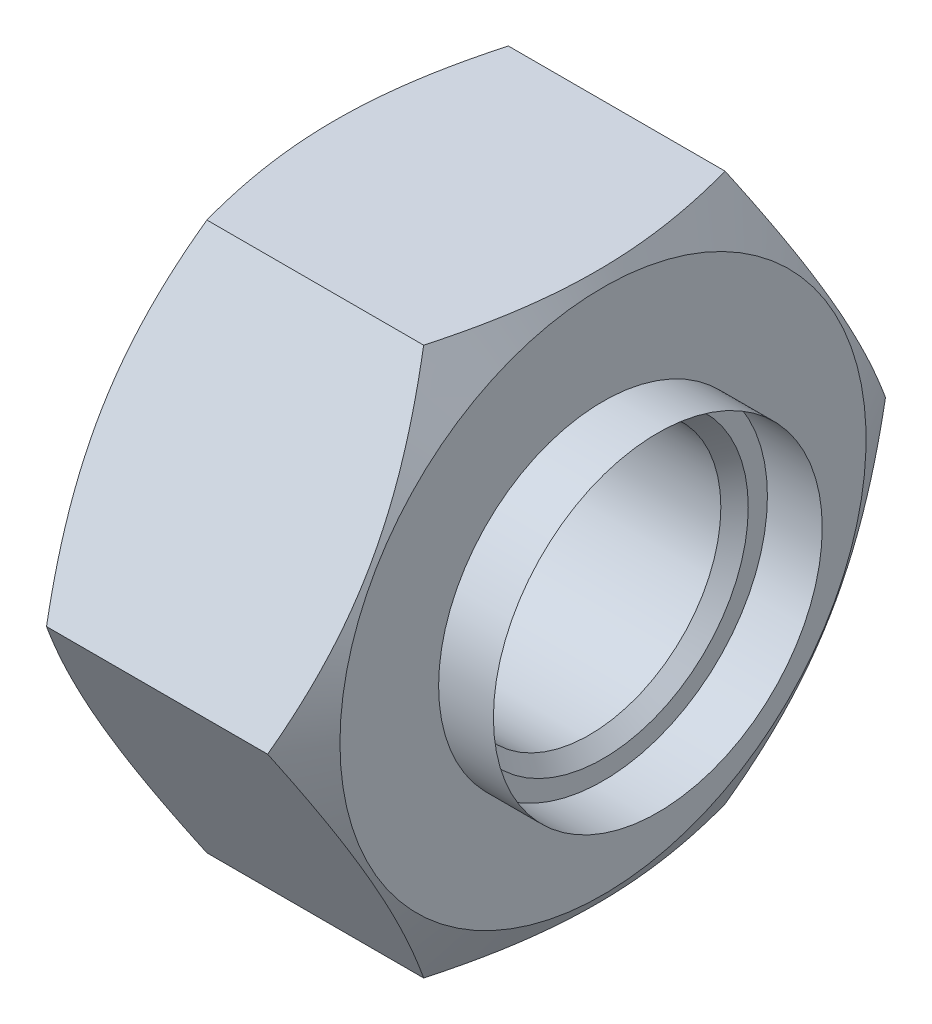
ISO-10303-21;
HEADER;
FILE_DESCRIPTION(('STEP AP214'),'2;1');
FILE_NAME('part.step','',(''),(''),'','','');
FILE_SCHEMA(('AUTOMOTIVE_DESIGN { 1 0 10303 214 1 1 1 1 }'));
ENDSEC;
DATA;
#1=APPLICATION_CONTEXT('core data for automotive mechanical design processes');
#2=APPLICATION_PROTOCOL_DEFINITION('international standard','automotive_design',2000,#1);
#3=PRODUCT_CONTEXT('',#1,'mechanical');
#4=PRODUCT('Part','Part','',(#3));
#5=PRODUCT_RELATED_PRODUCT_CATEGORY('part','',(#4));
#6=PRODUCT_DEFINITION_FORMATION('','',#4);
#7=PRODUCT_DEFINITION_CONTEXT('part definition',#1,'design');
#8=PRODUCT_DEFINITION('design','',#6,#7);
#9=PRODUCT_DEFINITION_SHAPE('','',#8);
#10=(LENGTH_UNIT() NAMED_UNIT(*) SI_UNIT(.MILLI.,.METRE.));
#11=(NAMED_UNIT(*) PLANE_ANGLE_UNIT() SI_UNIT($,.RADIAN.));
#12=(NAMED_UNIT(*) SI_UNIT($,.STERADIAN.) SOLID_ANGLE_UNIT());
#13=UNCERTAINTY_MEASURE_WITH_UNIT(LENGTH_MEASURE(1.E-05),#10,'distance_accuracy_value','');
#14=(GEOMETRIC_REPRESENTATION_CONTEXT(3) GLOBAL_UNCERTAINTY_ASSIGNED_CONTEXT((#13)) GLOBAL_UNIT_ASSIGNED_CONTEXT((#10,
#11,#12)) REPRESENTATION_CONTEXT('',''));
#15=CARTESIAN_POINT('',(0.,0.,0.));
#16=DIRECTION('',(0.,0.,1.));
#17=DIRECTION('',(1.,0.,0.));
#18=AXIS2_PLACEMENT_3D('',#15,#16,#17);
#19=CARTESIAN_POINT('',(-5.,0.,0.));
#20=DIRECTION('',(-1.,0.,0.));
#21=DIRECTION('',(0.,0.,1.));
#22=AXIS2_PLACEMENT_3D('',#19,#20,#21);
#23=CYLINDRICAL_SURFACE('',#22,3.);
#24=CARTESIAN_POINT('',(1.,0.,0.));
#25=DIRECTION('',(-1.,0.,0.));
#26=DIRECTION('',(0.,0.,1.));
#27=AXIS2_PLACEMENT_3D('',#24,#25,#26);
#28=CIRCLE('',#27,3.);
#29=CARTESIAN_POINT('',(1.,0.,3.));
#30=VERTEX_POINT('',#29);
#31=EDGE_CURVE('P0_E15',#30,#30,#28,.T.);
#32=ORIENTED_EDGE('',*,*,#31,.T.);
#33=EDGE_LOOP('',(#32));
#34=FACE_BOUND('',#33,.T.);
#35=CARTESIAN_POINT('',(-5.,0.,0.));
#36=DIRECTION('',(-1.,0.,0.));
#37=DIRECTION('',(0.,0.,1.));
#38=AXIS2_PLACEMENT_3D('',#35,#36,#37);
#39=CIRCLE('',#38,3.);
#40=CARTESIAN_POINT('',(-5.,0.,3.));
#41=VERTEX_POINT('',#40);
#42=EDGE_CURVE('P0_E10',#41,#41,#39,.F.);
#43=ORIENTED_EDGE('',*,*,#42,.T.);
#44=EDGE_LOOP('',(#43));
#45=FACE_BOUND('',#44,.T.);
#46=ADVANCED_FACE('P0_F14',(#34,#45),#23,.T.);
#47=OPEN_SHELL('',(#46));
#48=SHELL_BASED_SURFACE_MODEL('P0_B1',(#47));
#49=CARTESIAN_POINT('',(0.,27.5,-24.98464223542));
#50=DIRECTION('',(-1.,0.,0.));
#51=DIRECTION('',(0.,0.,1.));
#52=AXIS2_PLACEMENT_3D('',#49,#50,#51);
#53=PLANE('',#52);
#54=CARTESIAN_POINT('',(5.6843418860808E-11,0.,0.));
#55=DIRECTION('',(1.,0.,0.));
#56=DIRECTION('',(0.,0.,-1.));
#57=AXIS2_PLACEMENT_3D('',#54,#55,#56);
#58=CIRCLE('',#57,2.65000000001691);
#59=CARTESIAN_POINT('',(5.6843418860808E-11,0.,-2.65000000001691));
#60=VERTEX_POINT('',#59);
#61=EDGE_CURVE('P1_E78',#60,#60,#58,.F.);
#62=ORIENTED_EDGE('',*,*,#61,.T.);
#63=EDGE_LOOP('',(#62));
#64=FACE_BOUND('',#63,.T.);
#65=CARTESIAN_POINT('',(0.,0.,0.));
#66=DIRECTION('',(-1.,0.,0.));
#67=DIRECTION('',(0.,0.,1.));
#68=AXIS2_PLACEMENT_3D('',#65,#66,#67);
#69=CIRCLE('',#68,4.79999999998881);
#70=CARTESIAN_POINT('',(0.,0.,4.79999999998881));
#71=VERTEX_POINT('',#70);
#72=EDGE_CURVE('P1_E19',#71,#71,#69,.T.);
#73=ORIENTED_EDGE('',*,*,#72,.F.);
#74=EDGE_LOOP('',(#73));
#75=FACE_BOUND('',#74,.T.);
#76=ADVANCED_FACE('P1_F16',(#64,#75),#53,.F.);
#77=CARTESIAN_POINT('',(-0.526035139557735,0.,0.));
#78=DIRECTION('',(-1.,0.,0.));
#79=DIRECTION('',(0.,0.,1.));
#80=AXIS2_PLACEMENT_3D('',#77,#78,#79);
#81=CONICAL_SURFACE('',#80,5.71179424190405,1.04751800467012);
#82=ORIENTED_EDGE('',*,*,#72,.T.);
#83=EDGE_LOOP('',(#82));
#84=FACE_BOUND('',#83,.T.);
#85=CARTESIAN_POINT('',(-0.522897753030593,-5.,-2.75000000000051));
#86=CARTESIAN_POINT('',(-0.460057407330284,-5.,-2.52404723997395));
#87=CARTESIAN_POINT('',(-0.402715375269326,-5.,-2.29639349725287));
#88=CARTESIAN_POINT('',(-0.301612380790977,-5.,-1.83766805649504));
#89=CARTESIAN_POINT('',(-0.25787706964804,-5.,-1.60659075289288));
#90=CARTESIAN_POINT('',(-0.187587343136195,-5.,-1.14682143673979));
#91=CARTESIAN_POINT('',(-0.160685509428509,-5.,-0.918184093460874));
#92=CARTESIAN_POINT('',(-0.12459225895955,-5.,-0.459696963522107));
#93=CARTESIAN_POINT('',(-0.115384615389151,-5.,-0.229848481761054));
#94=CARTESIAN_POINT('',(-0.115384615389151,-5.,0.229848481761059));
#95=CARTESIAN_POINT('',(-0.124592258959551,-5.,0.459696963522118));
#96=CARTESIAN_POINT('',(-0.160685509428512,-5.,0.918184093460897));
#97=CARTESIAN_POINT('',(-0.187587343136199,-5.,1.14682143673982));
#98=CARTESIAN_POINT('',(-0.257877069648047,-5.,1.60659075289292));
#99=CARTESIAN_POINT('',(-0.301612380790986,-5.,1.83766805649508));
#100=CARTESIAN_POINT('',(-0.40271537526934,-5.,2.29639349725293));
#101=CARTESIAN_POINT('',(-0.460057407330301,-5.,2.52404723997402));
#102=CARTESIAN_POINT('',(-0.522897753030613,-5.,2.75000000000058));
#103=B_SPLINE_CURVE_WITH_KNOTS('',3,(#85,#86,#87,#88,#89,#90,#91,#92,#93,#94,#95,#96,#97,#98,
#99,#100,#101,#102),.UNSPECIFIED.,.F.,.F.,(4,2,2,2,2,2,2,2,4),(0.,0.703766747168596,
1.40885230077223,2.09885933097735,2.78823327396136,3.47760721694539,4.16761424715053,
4.87269980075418,5.5764665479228),.UNSPECIFIED.);
#104=CARTESIAN_POINT('',(-0.522897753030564,-5.00000000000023,-2.75));
#105=VERTEX_POINT('',#104);
#106=CARTESIAN_POINT('',(-0.522897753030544,-5.00000000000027,2.74999999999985));
#107=VERTEX_POINT('',#106);
#108=EDGE_CURVE('P1_E72',#105,#107,#103,.T.);
#109=ORIENTED_EDGE('',*,*,#108,.F.);
#110=CARTESIAN_POINT('',(-0.48274116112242,4.36393286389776E-13,-5.63675134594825));
#111=CARTESIAN_POINT('',(-0.411260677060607,-0.214538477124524,-5.51288749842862));
#112=CARTESIAN_POINT('',(-0.346254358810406,-0.43092623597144,-5.38795596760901));
#113=CARTESIAN_POINT('',(-0.232789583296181,-0.8674484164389,-5.13592976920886));
#114=CARTESIAN_POINT('',(-0.184371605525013,-1.08759064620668,-5.00883059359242));
#115=CARTESIAN_POINT('',(-0.109022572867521,-1.52507066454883,-4.75625138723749));
#116=CARTESIAN_POINT('',(-0.0815831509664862,-1.74234034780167,-4.63081067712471));
#117=CARTESIAN_POINT('',(-0.048826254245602,-2.17789309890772,-4.37934417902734));
#118=CARTESIAN_POINT('',(-0.0434812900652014,-2.39617456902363,-4.25331931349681));
#119=CARTESIAN_POINT('',(-0.0548801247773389,-2.81409569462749,-4.01203243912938));
#120=CARTESIAN_POINT('',(-0.0698224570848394,-3.01377478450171,-3.89674766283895));
#121=CARTESIAN_POINT('',(-0.117432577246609,-3.4117266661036,-3.66699003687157));
#122=CARTESIAN_POINT('',(-0.150119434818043,-3.60999771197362,-3.55251819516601));
#123=CARTESIAN_POINT('',(-0.231804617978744,-4.00878966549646,-3.32227555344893));
#124=CARTESIAN_POINT('',(-0.281171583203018,-4.20925232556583,-3.2065383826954));
#125=CARTESIAN_POINT('',(-0.392969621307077,-4.60696569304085,-2.97691846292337));
#126=CARTESIAN_POINT('',(-0.455370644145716,-4.80422268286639,-2.86303208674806));
#127=CARTESIAN_POINT('',(-0.522897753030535,-5.00000000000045,-2.74999999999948));
#128=B_SPLINE_CURVE_WITH_KNOTS('',3,(#110,#111,#112,#113,#114,#115,#116,#117,#118,#119,#120,
#121,#122,#123,#124,#125,#126,#127),.UNSPECIFIED.,.F.,.F.,(4,2,2,2,2,2,2,2,4),(0.,
0.77380589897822,1.54948683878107,2.30571654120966,3.06100507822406,3.75342935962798,
4.44659925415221,5.15621689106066,5.86421621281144),.UNSPECIFIED.);
#129=CARTESIAN_POINT('',(-0.482741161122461,0.,-5.63675134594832));
#130=VERTEX_POINT('',#129);
#131=EDGE_CURVE('P1_E91',#130,#105,#128,.T.);
#132=ORIENTED_EDGE('',*,*,#131,.F.);
#133=CARTESIAN_POINT('',(-0.522897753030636,5.00000000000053,-2.74999999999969));
#134=CARTESIAN_POINT('',(-0.44821579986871,4.78348598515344,-2.87500442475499));
#135=CARTESIAN_POINT('',(-0.379798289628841,4.56513107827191,-3.00107168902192));
#136=CARTESIAN_POINT('',(-0.259235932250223,4.12449649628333,-3.2554721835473));
#137=CARTESIAN_POINT('',(-0.207135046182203,3.90220789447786,-3.38381056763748));
#138=CARTESIAN_POINT('',(-0.124458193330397,3.46032899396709,-3.6389294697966));
#139=CARTESIAN_POINT('',(-0.0933673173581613,3.24081438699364,-3.76566628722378));
#140=CARTESIAN_POINT('',(-0.0634606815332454,2.91058577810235,-3.9563238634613));
#141=CARTESIAN_POINT('',(-0.0562794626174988,2.80040896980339,-4.01993447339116));
#142=CARTESIAN_POINT('',(-0.04762970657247,2.57988872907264,-4.14725189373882));
#143=CARTESIAN_POINT('',(-0.0461610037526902,2.4695453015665,-4.2109587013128));
#144=CARTESIAN_POINT('',(-0.0501283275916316,2.16188369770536,-4.38858721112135));
#145=CARTESIAN_POINT('',(-0.0619232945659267,1.96460341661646,-4.50248703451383));
#146=CARTESIAN_POINT('',(-0.103089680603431,1.57126669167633,-4.7295800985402));
#147=CARTESIAN_POINT('',(-0.132479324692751,1.37521173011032,-4.8427724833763));
#148=CARTESIAN_POINT('',(-0.207547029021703,0.980802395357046,-5.07048481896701));
#149=CARTESIAN_POINT('',(-0.253590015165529,0.782501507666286,-5.18497388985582));
#150=CARTESIAN_POINT('',(-0.358930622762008,0.388980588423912,-5.41217329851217));
#151=CARTESIAN_POINT('',(-0.41819977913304,0.19375489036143,-5.52488690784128));
#152=CARTESIAN_POINT('',(-0.482741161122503,-2.37488008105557E-13,-5.6367513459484));
#153=B_SPLINE_CURVE_WITH_KNOTS('',3,(#133,#134,#135,#136,#137,#138,#139,#140,#141,#142,#143,
#144,#145,#146,#147,#148,#149,#150,#151,#152),.UNSPECIFIED.,.F.,.F.,(4,2,2,2,2,2,2,2,2,4),(0.,
0.783055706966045,1.56820336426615,2.33333381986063,2.71549280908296,3.09764071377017,
3.78117114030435,4.46541081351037,5.16565571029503,5.86440784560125),.UNSPECIFIED.);
#154=CARTESIAN_POINT('',(-0.522897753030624,5.00000000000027,-2.75000000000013));
#155=VERTEX_POINT('',#154);
#156=EDGE_CURVE('P1_E130',#155,#130,#153,.T.);
#157=ORIENTED_EDGE('',*,*,#156,.F.);
#158=CARTESIAN_POINT('',(-0.522897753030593,5.,2.75000000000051));
#159=CARTESIAN_POINT('',(-0.460057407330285,5.,2.52404723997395));
#160=CARTESIAN_POINT('',(-0.402715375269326,5.,2.29639349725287));
#161=CARTESIAN_POINT('',(-0.301612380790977,5.,1.83766805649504));
#162=CARTESIAN_POINT('',(-0.25787706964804,5.,1.60659075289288));
#163=CARTESIAN_POINT('',(-0.187587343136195,5.,1.14682143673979));
#164=CARTESIAN_POINT('',(-0.16068550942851,5.,0.918184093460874));
#165=CARTESIAN_POINT('',(-0.12459225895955,5.,0.459696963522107));
#166=CARTESIAN_POINT('',(-0.115384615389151,5.,0.229848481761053));
#167=CARTESIAN_POINT('',(-0.115384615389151,5.,-0.229848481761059));
#168=CARTESIAN_POINT('',(-0.124592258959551,5.,-0.459696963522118));
#169=CARTESIAN_POINT('',(-0.160685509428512,5.,-0.918184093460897));
#170=CARTESIAN_POINT('',(-0.187587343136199,5.,-1.14682143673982));
#171=CARTESIAN_POINT('',(-0.257877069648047,5.,-1.60659075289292));
#172=CARTESIAN_POINT('',(-0.301612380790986,5.,-1.83766805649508));
#173=CARTESIAN_POINT('',(-0.40271537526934,5.,-2.29639349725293));
#174=CARTESIAN_POINT('',(-0.460057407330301,5.,-2.52404723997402));
#175=CARTESIAN_POINT('',(-0.522897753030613,5.,-2.75000000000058));
#176=B_SPLINE_CURVE_WITH_KNOTS('',3,(#158,#159,#160,#161,#162,#163,#164,#165,#166,#167,#168,
#169,#170,#171,#172,#173,#174,#175),.UNSPECIFIED.,.F.,.F.,(4,2,2,2,2,2,2,2,4),(0.,
0.703766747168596,1.40885230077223,2.09885933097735,2.78823327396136,3.47760721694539,
4.16761424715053,4.87269980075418,5.5764665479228),.UNSPECIFIED.);
#177=CARTESIAN_POINT('',(-0.522897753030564,5.00000000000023,2.75));
#178=VERTEX_POINT('',#177);
#179=EDGE_CURVE('P1_E137',#178,#155,#176,.T.);
#180=ORIENTED_EDGE('',*,*,#179,.F.);
#181=CARTESIAN_POINT('',(-0.482741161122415,-4.21141161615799E-13,5.63675134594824));
#182=CARTESIAN_POINT('',(-0.411260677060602,0.214538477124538,5.51288749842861));
#183=CARTESIAN_POINT('',(-0.346254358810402,0.430926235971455,5.387955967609));
#184=CARTESIAN_POINT('',(-0.232789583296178,0.867448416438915,5.13592976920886));
#185=CARTESIAN_POINT('',(-0.18437160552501,1.0875906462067,5.00883059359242));
#186=CARTESIAN_POINT('',(-0.109022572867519,1.52507066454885,4.75625138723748));
#187=CARTESIAN_POINT('',(-0.0815831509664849,1.74234034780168,4.63081067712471));
#188=CARTESIAN_POINT('',(-0.0488262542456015,2.17789309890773,4.37934417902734));
#189=CARTESIAN_POINT('',(-0.0434812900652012,2.39617456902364,4.2533193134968));
#190=CARTESIAN_POINT('',(-0.0548801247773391,2.8140956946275,4.01203243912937));
#191=CARTESIAN_POINT('',(-0.0698224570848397,3.01377478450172,3.89674766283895));
#192=CARTESIAN_POINT('',(-0.11743257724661,3.41172666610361,3.66699003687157));
#193=CARTESIAN_POINT('',(-0.150119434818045,3.60999771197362,3.552518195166));
#194=CARTESIAN_POINT('',(-0.231804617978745,4.00878966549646,3.32227555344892));
#195=CARTESIAN_POINT('',(-0.281171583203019,4.20925232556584,3.20653838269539));
#196=CARTESIAN_POINT('',(-0.392969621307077,4.60696569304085,2.97691846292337));
#197=CARTESIAN_POINT('',(-0.455370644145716,4.80422268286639,2.86303208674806));
#198=CARTESIAN_POINT('',(-0.522897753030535,5.00000000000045,2.74999999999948));
#199=B_SPLINE_CURVE_WITH_KNOTS('',3,(#181,#182,#183,#184,#185,#186,#187,#188,#189,#190,#191,
#192,#193,#194,#195,#196,#197,#198),.UNSPECIFIED.,.F.,.F.,(4,2,2,2,2,2,2,2,4),(0.,
0.773805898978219,1.54948683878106,2.30571654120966,3.06100507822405,3.75342935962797,
4.4465992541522,5.15621689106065,5.86421621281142),.UNSPECIFIED.);
#200=CARTESIAN_POINT('',(-0.482741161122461,0.,5.63675134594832));
#201=VERTEX_POINT('',#200);
#202=EDGE_CURVE('P1_E74',#201,#178,#199,.T.);
#203=ORIENTED_EDGE('',*,*,#202,.F.);
#204=CARTESIAN_POINT('',(-0.522897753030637,-5.00000000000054,2.74999999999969));
#205=CARTESIAN_POINT('',(-0.448215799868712,-4.78348598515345,2.87500442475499));
#206=CARTESIAN_POINT('',(-0.379798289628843,-4.56513107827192,3.00107168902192));
#207=CARTESIAN_POINT('',(-0.259235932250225,-4.12449649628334,3.2554721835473));
#208=CARTESIAN_POINT('',(-0.207135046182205,-3.90220789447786,3.38381056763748));
#209=CARTESIAN_POINT('',(-0.124458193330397,-3.4603289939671,3.6389294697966));
#210=CARTESIAN_POINT('',(-0.0933673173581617,-3.24081438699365,3.76566628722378));
#211=CARTESIAN_POINT('',(-0.0634606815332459,-2.91058577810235,3.95632386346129));
#212=CARTESIAN_POINT('',(-0.0562794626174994,-2.80040896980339,4.01993447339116));
#213=CARTESIAN_POINT('',(-0.0476297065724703,-2.57988872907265,4.14725189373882));
#214=CARTESIAN_POINT('',(-0.0461610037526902,-2.4695453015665,4.2109587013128));
#215=CARTESIAN_POINT('',(-0.0501283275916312,-2.16188369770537,4.38858721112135));
#216=CARTESIAN_POINT('',(-0.0619232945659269,-1.96460341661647,4.50248703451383));
#217=CARTESIAN_POINT('',(-0.103089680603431,-1.57126669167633,4.7295800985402));
#218=CARTESIAN_POINT('',(-0.132479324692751,-1.37521173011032,4.8427724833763));
#219=CARTESIAN_POINT('',(-0.207547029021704,-0.980802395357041,5.07048481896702));
#220=CARTESIAN_POINT('',(-0.25359001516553,-0.782501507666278,5.18497388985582));
#221=CARTESIAN_POINT('',(-0.358930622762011,-0.388980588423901,5.41217329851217));
#222=CARTESIAN_POINT('',(-0.418199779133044,-0.193754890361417,5.52488690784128));
#223=CARTESIAN_POINT('',(-0.482741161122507,2.53065473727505E-13,5.6367513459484));
#224=B_SPLINE_CURVE_WITH_KNOTS('',3,(#204,#205,#206,#207,#208,#209,#210,#211,#212,#213,#214,
#215,#216,#217,#218,#219,#220,#221,#222,#223),.UNSPECIFIED.,.F.,.F.,(4,2,2,2,2,2,2,2,2,4),(0.,
0.783055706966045,1.56820336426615,2.33333381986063,2.71549280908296,3.09764071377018,
3.78117114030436,4.46541081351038,5.16565571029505,5.86440784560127),.UNSPECIFIED.);
#225=EDGE_CURVE('P1_E67',#107,#201,#224,.T.);
#226=ORIENTED_EDGE('',*,*,#225,.F.);
#227=EDGE_LOOP('',(#109,#132,#157,#180,#203,#226));
#228=FACE_BOUND('',#227,.T.);
#229=ADVANCED_FACE('P1_F69',(#84,#228),#81,.T.);
#230=CARTESIAN_POINT('',(5.6843418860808E-11,0.,0.));
#231=DIRECTION('',(1.,0.,0.));
#232=DIRECTION('',(0.,0.,-1.));
#233=AXIS2_PLACEMENT_3D('',#230,#231,#232);
#234=CONICAL_SURFACE('',#233,2.65000000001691,0.785398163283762);
#235=CARTESIAN_POINT('',(-0.2500000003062,0.,0.));
#236=DIRECTION('',(1.,0.,0.));
#237=DIRECTION('',(0.,0.,-1.));
#238=AXIS2_PLACEMENT_3D('',#235,#236,#237);
#239=CIRCLE('',#238,2.4);
#240=CARTESIAN_POINT('',(-0.2500000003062,0.,-2.4));
#241=VERTEX_POINT('',#240);
#242=EDGE_CURVE('P1_E87',#241,#241,#239,.F.);
#243=ORIENTED_EDGE('',*,*,#242,.T.);
#244=EDGE_LOOP('',(#243));
#245=FACE_BOUND('',#244,.T.);
#246=ORIENTED_EDGE('',*,*,#61,.F.);
#247=EDGE_LOOP('',(#246));
#248=FACE_BOUND('',#247,.T.);
#249=ADVANCED_FACE('P1_F118',(#245,#248),#234,.F.);
#250=CARTESIAN_POINT('',(0.,-5.,2.75));
#251=DIRECTION('',(0.,-0.500000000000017,0.866025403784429));
#252=DIRECTION('',(0.,-0.866025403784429,-0.500000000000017));
#253=AXIS2_PLACEMENT_3D('',#250,#251,#252);
#254=PLANE('',#253);
#255=DIRECTION('',(1.,0.,0.));
#256=VECTOR('',#255,1.);
#257=CARTESIAN_POINT('',(0.,0.,5.636751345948));
#258=LINE('',#257,#256);
#259=CARTESIAN_POINT('',(-4.51725883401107,-1.44243114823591E-08,5.63675135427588));
#260=VERTEX_POINT('',#259);
#261=EDGE_CURVE('P1_E77',#260,#201,#258,.T.);
#262=ORIENTED_EDGE('',*,*,#261,.F.);
#263=CARTESIAN_POINT('',(-4.4771022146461,-5.00000000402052,2.74999995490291));
#264=CARTESIAN_POINT('',(-4.55178418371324,-4.78348600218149,2.87500439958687));
#265=CARTESIAN_POINT('',(-4.62020170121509,-4.56513109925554,3.00107167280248));
#266=CARTESIAN_POINT('',(-4.74076406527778,-4.1244965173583,3.25547217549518));
#267=CARTESIAN_POINT('',(-4.79286495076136,-3.90220791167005,3.38381055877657));
#268=CARTESIAN_POINT('',(-4.87554180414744,-3.46032900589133,3.63892946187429));
#269=CARTESIAN_POINT('',(-4.90663268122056,-3.24081439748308,3.76566628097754));
#270=CARTESIAN_POINT('',(-4.93653931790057,-2.91058578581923,3.95632385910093));
#271=CARTESIAN_POINT('',(-4.94372053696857,-2.80040897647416,4.01993446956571));
#272=CARTESIAN_POINT('',(-4.9523702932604,-2.57988873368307,4.14725189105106));
#273=CARTESIAN_POINT('',(-4.95383899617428,-2.46954530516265,4.21095869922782));
#274=CARTESIAN_POINT('',(-4.94987167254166,-2.16188370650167,4.38858720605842));
#275=CARTESIAN_POINT('',(-4.93807670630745,-1.96460343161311,4.50248702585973));
#276=CARTESIAN_POINT('',(-4.8969103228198,-1.57126671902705,4.72958008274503));
#277=CARTESIAN_POINT('',(-4.86752068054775,-1.37521176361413,4.84277246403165));
#278=CARTESIAN_POINT('',(-4.79245298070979,-0.98080244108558,5.07048479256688));
#279=CARTESIAN_POINT('',(-4.74640999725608,-0.782501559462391,5.18497385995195));
#280=CARTESIAN_POINT('',(-4.64106939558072,-0.388980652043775,5.4121732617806));
#281=CARTESIAN_POINT('',(-4.58180024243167,-0.193754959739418,5.52488686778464));
#282=CARTESIAN_POINT('',(-4.51725886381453,-7.50527263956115E-08,5.63675130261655));
#283=B_SPLINE_CURVE_WITH_KNOTS('',3,(#263,#264,#265,#266,#267,#268,#269,#270,#271,#272,#273,
#274,#275,#276,#277,#278,#279,#280,#281,#282),.UNSPECIFIED.,.F.,.F.,(4,2,2,2,2,2,2,2,2,4),(0.,
0.783055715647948,1.56820338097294,2.33333384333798,2.71549283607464,3.09764074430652,
3.78117114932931,4.46541080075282,5.16565567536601,5.86440778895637),.UNSPECIFIED.);
#284=CARTESIAN_POINT('',(-4.47710224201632,-5.00000001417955,2.74999999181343));
#285=VERTEX_POINT('',#284);
#286=EDGE_CURVE('P1_E85',#285,#260,#283,.T.);
#287=ORIENTED_EDGE('',*,*,#286,.F.);
#288=DIRECTION('',(1.,0.,0.));
#289=VECTOR('',#288,1.);
#290=CARTESIAN_POINT('',(0.,-5.,2.75));
#291=LINE('',#290,#289);
#292=EDGE_CURVE('P1_E82',#107,#285,#291,.F.);
#293=ORIENTED_EDGE('',*,*,#292,.F.);
#294=ORIENTED_EDGE('',*,*,#225,.T.);
#295=EDGE_LOOP('',(#262,#287,#293,#294));
#296=FACE_BOUND('',#295,.T.);
#297=ADVANCED_FACE('P1_F83',(#296),#254,.T.);
#298=CARTESIAN_POINT('',(0.,0.,5.636751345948));
#299=DIRECTION('',(0.,0.500000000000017,0.866025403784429));
#300=DIRECTION('',(0.,-0.866025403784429,0.500000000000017));
#301=AXIS2_PLACEMENT_3D('',#298,#299,#300);
#302=PLANE('',#301);
#303=DIRECTION('',(1.,0.,0.));
#304=VECTOR('',#303,1.);
#305=CARTESIAN_POINT('',(0.,5.,2.75));
#306=LINE('',#305,#304);
#307=CARTESIAN_POINT('',(-4.47710224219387,5.,2.75000001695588));
#308=VERTEX_POINT('',#307);
#309=EDGE_CURVE('P1_E144',#308,#178,#306,.T.);
#310=ORIENTED_EDGE('',*,*,#309,.F.);
#311=CARTESIAN_POINT('',(-4.51725880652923,-4.19389413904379E-08,5.63675132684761));
#312=CARTESIAN_POINT('',(-4.58873930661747,0.214538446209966,5.51288750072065));
#313=CARTESIAN_POINT('',(-4.65374563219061,0.430926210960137,5.38795597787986));
#314=CARTESIAN_POINT('',(-4.7672104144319,0.867448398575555,5.1359297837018));
#315=CARTESIAN_POINT('',(-4.81562839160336,1.08759062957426,5.00883060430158));
#316=CARTESIAN_POINT('',(-4.89097742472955,1.52507065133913,4.75625139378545));
#317=CARTESIAN_POINT('',(-4.91841684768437,1.7423403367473,4.63081068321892));
#318=CARTESIAN_POINT('',(-4.95117374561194,2.1778930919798,4.37934418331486));
#319=CARTESIAN_POINT('',(-4.95651870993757,2.39617456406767,4.25331931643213));
#320=CARTESIAN_POINT('',(-4.94511987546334,2.81409568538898,4.01203244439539));
#321=CARTESIAN_POINT('',(-4.93017754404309,3.01377476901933,3.89674767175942));
#322=CARTESIAN_POINT('',(-4.88256742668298,3.41172663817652,3.66699005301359));
#323=CARTESIAN_POINT('',(-4.84988057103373,3.60999767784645,3.55251821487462));
#324=CARTESIAN_POINT('',(-4.76819539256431,4.00878961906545,3.32227558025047));
#325=CARTESIAN_POINT('',(-4.71882843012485,4.20925227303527,3.20653841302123));
#326=CARTESIAN_POINT('',(-4.60703039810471,4.60696562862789,2.97691850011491));
#327=CARTESIAN_POINT('',(-4.54462937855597,4.80422261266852,2.8630321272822));
#328=CARTESIAN_POINT('',(-4.47710227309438,4.99999992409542,2.75000004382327));
#329=B_SPLINE_CURVE_WITH_KNOTS('',3,(#311,#312,#313,#314,#315,#316,#317,#318,#319,#320,#321,
#322,#323,#324,#325,#326,#327,#328),.UNSPECIFIED.,.F.,.F.,(4,2,2,2,2,2,2,2,4),(0.,
0.773805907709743,1.54948685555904,2.30571656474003,3.06100510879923,3.75342936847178,
4.44659924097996,5.15621685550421,5.86421615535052),.UNSPECIFIED.);
#330=EDGE_CURVE('P1_E168',#260,#308,#329,.T.);
#331=ORIENTED_EDGE('',*,*,#330,.F.);
#332=ORIENTED_EDGE('',*,*,#261,.T.);
#333=ORIENTED_EDGE('',*,*,#202,.T.);
#334=EDGE_LOOP('',(#310,#331,#332,#333));
#335=FACE_BOUND('',#334,.T.);
#336=ADVANCED_FACE('P1_F154',(#335),#302,.T.);
#337=CARTESIAN_POINT('',(0.,5.,2.75));
#338=DIRECTION('',(0.,1.,0.));
#339=DIRECTION('',(0.,0.,1.));
#340=AXIS2_PLACEMENT_3D('',#337,#338,#339);
#341=PLANE('',#340);
#342=DIRECTION('',(1.,0.,0.));
#343=VECTOR('',#342,1.);
#344=CARTESIAN_POINT('',(0.,5.,-2.75));
#345=LINE('',#344,#343);
#346=CARTESIAN_POINT('',(-4.47710224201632,5.00000001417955,-2.74999999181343));
#347=VERTEX_POINT('',#346);
#348=EDGE_CURVE('P1_E143',#347,#155,#345,.T.);
#349=ORIENTED_EDGE('',*,*,#348,.F.);
#350=CARTESIAN_POINT('',(-4.47710221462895,4.99999996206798,2.75000002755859));
#351=CARTESIAN_POINT('',(-4.5399425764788,4.99999998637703,2.52404726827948));
#352=CARTESIAN_POINT('',(-4.59728461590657,4.99999999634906,2.29639352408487));
#353=CARTESIAN_POINT('',(-4.69838761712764,5.00000000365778,1.83766807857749));
#354=CARTESIAN_POINT('',(-4.74212292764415,5.00000000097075,1.60659077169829));
#355=CARTESIAN_POINT('',(-4.81241265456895,4.99999999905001,1.14682144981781));
#356=CARTESIAN_POINT('',(-4.83931448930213,4.99999999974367,0.918184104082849));
#357=CARTESIAN_POINT('',(-4.87540774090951,5.0000000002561,0.459696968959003));
#358=CARTESIAN_POINT('',(-4.88461538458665,5.00000000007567,0.229848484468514));
#359=CARTESIAN_POINT('',(-4.88461538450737,4.99999999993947,-0.229848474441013));
#360=CARTESIAN_POINT('',(-4.87540774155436,4.99999999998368,-0.459696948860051));
#361=CARTESIAN_POINT('',(-4.83931449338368,5.00000000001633,-0.91818406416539));
#362=CARTESIAN_POINT('',(-4.81241266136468,5.00000000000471,-1.14682140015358));
#363=CARTESIAN_POINT('',(-4.74212293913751,4.99999999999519,-1.60659070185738));
#364=CARTESIAN_POINT('',(-4.69838763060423,4.9999999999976,-1.83766799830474));
#365=CARTESIAN_POINT('',(-4.59728464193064,5.0000000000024,-2.2963934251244));
#366=CARTESIAN_POINT('',(-4.53994261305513,5.00000000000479,-2.52404716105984));
#367=CARTESIAN_POINT('',(-4.47710227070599,5.,-2.74999991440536));
#368=B_SPLINE_CURVE_WITH_KNOTS('',3,(#350,#351,#352,#353,#354,#355,#356,#357,#358,#359,#360,
#361,#362,#363,#364,#365,#366,#367),.UNSPECIFIED.,.F.,.F.,(4,2,2,2,2,2,2,2,4),(0.,
0.703766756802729,1.40885231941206,2.09885935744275,2.78823330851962,3.47760722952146,
4.16761423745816,4.87269976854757,5.57646649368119),.UNSPECIFIED.);
#369=EDGE_CURVE('P1_E160',#308,#347,#368,.T.);
#370=ORIENTED_EDGE('',*,*,#369,.F.);
#371=ORIENTED_EDGE('',*,*,#309,.T.);
#372=ORIENTED_EDGE('',*,*,#179,.T.);
#373=EDGE_LOOP('',(#349,#370,#371,#372));
#374=FACE_BOUND('',#373,.T.);
#375=ADVANCED_FACE('P1_F150',(#374),#341,.T.);
#376=CARTESIAN_POINT('',(0.,5.,-2.75));
#377=DIRECTION('',(0.,0.500000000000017,-0.866025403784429));
#378=DIRECTION('',(0.,0.866025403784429,0.500000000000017));
#379=AXIS2_PLACEMENT_3D('',#376,#377,#378);
#380=PLANE('',#379);
#381=DIRECTION('',(1.,0.,0.));
#382=VECTOR('',#381,1.);
#383=CARTESIAN_POINT('',(0.,0.,-5.636751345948));
#384=LINE('',#383,#382);
#385=CARTESIAN_POINT('',(-4.51725884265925,-1.15394480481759E-08,-5.6367513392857));
#386=VERTEX_POINT('',#385);
#387=EDGE_CURVE('P1_E238',#386,#130,#384,.T.);
#388=ORIENTED_EDGE('',*,*,#387,.F.);
#389=CARTESIAN_POINT('',(-4.47710221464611,5.00000000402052,-2.74999995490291));
#390=CARTESIAN_POINT('',(-4.55178418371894,4.78348600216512,-2.87500439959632));
#391=CARTESIAN_POINT('',(-4.62020170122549,4.56513109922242,-3.0010716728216));
#392=CARTESIAN_POINT('',(-4.74076406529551,4.12449651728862,-3.25547217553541));
#393=CARTESIAN_POINT('',(-4.79286495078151,3.90220791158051,-3.38381055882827));
#394=CARTESIAN_POINT('',(-4.87554180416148,3.46032900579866,-3.63892946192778));
#395=CARTESIAN_POINT('',(-4.90663268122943,3.24081439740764,-3.7656662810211));
#396=CARTESIAN_POINT('',(-4.93653931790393,2.91058578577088,-3.95632385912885));
#397=CARTESIAN_POINT('',(-4.94372053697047,2.80040897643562,-4.01993446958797));
#398=CARTESIAN_POINT('',(-4.95237029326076,2.57988873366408,-4.14725189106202));
#399=CARTESIAN_POINT('',(-4.95383899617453,2.46954530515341,-4.21095869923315));
#400=CARTESIAN_POINT('',(-4.94987167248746,2.16188370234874,-4.38858720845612));
#401=CARTESIAN_POINT('',(-4.93807670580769,1.96460342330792,-4.50248703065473));
#402=CARTESIAN_POINT('',(-4.89691032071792,1.57126670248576,-4.72958009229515));
#403=CARTESIAN_POINT('',(-4.86752067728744,1.37521174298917,-4.84277247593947));
#404=CARTESIAN_POINT('',(-4.79245297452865,0.980802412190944,-5.0704848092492));
#405=CARTESIAN_POINT('',(-4.74640998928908,0.782501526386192,-5.1849738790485));
#406=CARTESIAN_POINT('',(-4.64106938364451,0.388980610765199,-5.4121732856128));
#407=CARTESIAN_POINT('',(-4.58180022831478,0.193754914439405,-5.52488689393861));
#408=CARTESIAN_POINT('',(-4.51725884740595,2.57905309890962E-08,-5.63675133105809));
#409=B_SPLINE_CURVE_WITH_KNOTS('',3,(#389,#390,#391,#392,#393,#394,#395,#396,#397,#398,#399,
#400,#401,#402,#403,#404,#405,#406,#407,#408),.UNSPECIFIED.,.F.,.F.,(4,2,2,2,2,2,2,2,2,4),(0.,
0.783055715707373,1.568203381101,2.33333384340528,2.71549283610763,3.09764074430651,
3.78117116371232,4.46541082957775,5.16565571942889,5.86440784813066),.UNSPECIFIED.);
#410=EDGE_CURVE('P1_E167',#347,#386,#409,.T.);
#411=ORIENTED_EDGE('',*,*,#410,.F.);
#412=ORIENTED_EDGE('',*,*,#348,.T.);
#413=ORIENTED_EDGE('',*,*,#156,.T.);
#414=EDGE_LOOP('',(#388,#411,#412,#413));
#415=FACE_BOUND('',#414,.T.);
#416=ADVANCED_FACE('P1_F153',(#415),#380,.T.);
#417=CARTESIAN_POINT('',(0.,0.,-5.636751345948));
#418=DIRECTION('',(0.,-0.500000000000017,-0.866025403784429));
#419=DIRECTION('',(0.,0.866025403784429,-0.500000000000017));
#420=AXIS2_PLACEMENT_3D('',#417,#418,#419);
#421=PLANE('',#420);
#422=DIRECTION('',(1.,0.,0.));
#423=VECTOR('',#422,1.);
#424=CARTESIAN_POINT('',(0.,-5.,-2.75));
#425=LINE('',#424,#423);
#426=CARTESIAN_POINT('',(-4.47710224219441,-5.,-2.75000001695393));
#427=VERTEX_POINT('',#426);
#428=EDGE_CURVE('P1_E34',#427,#105,#425,.T.);
#429=ORIENTED_EDGE('',*,*,#428,.F.);
#430=CARTESIAN_POINT('',(-4.51725883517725,-1.65412464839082E-08,-5.63675131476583));
#431=CARTESIAN_POINT('',(-4.58873932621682,-0.214538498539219,-5.51288747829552));
#432=CARTESIAN_POINT('',(-4.65374564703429,-0.430926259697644,-5.38795595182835));
#433=CARTESIAN_POINT('',(-4.76721042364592,-0.867448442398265,-5.13592975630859));
#434=CARTESIAN_POINT('',(-4.81562839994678,-1.0875906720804,-5.0088305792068));
#435=CARTESIAN_POINT('',(-4.89097743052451,-1.52507069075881,-4.75625137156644));
#436=CARTESIAN_POINT('',(-4.91841685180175,-1.74234037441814,-4.63081066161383));
#437=CARTESIAN_POINT('',(-4.95117374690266,-2.17789312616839,-4.37934416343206));
#438=CARTESIAN_POINT('',(-4.95651871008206,-2.39617459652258,-4.25331929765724));
#439=CARTESIAN_POINT('',(-4.94511987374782,-2.81409571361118,-4.01203242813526));
#440=CARTESIAN_POINT('',(-4.93017754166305,-3.01377479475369,-3.89674765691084));
#441=CARTESIAN_POINT('',(-4.88256742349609,-3.41172665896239,-3.66699004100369));
#442=CARTESIAN_POINT('',(-4.84988056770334,-3.60999769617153,-3.55251820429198));
#443=CARTESIAN_POINT('',(-4.76819538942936,-4.00878963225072,-3.32227557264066));
#444=CARTESIAN_POINT('',(-4.71882842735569,-4.20925228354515,-3.2065384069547));
#445=CARTESIAN_POINT('',(-4.60703039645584,-4.60696563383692,-2.97691849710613));
#446=CARTESIAN_POINT('',(-4.54462937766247,-4.80422261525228,-2.86303212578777));
#447=CARTESIAN_POINT('',(-4.47710227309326,-4.99999992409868,-2.75000004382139));
#448=B_SPLINE_CURVE_WITH_KNOTS('',3,(#430,#431,#432,#433,#434,#435,#436,#437,#438,#439,#440,
#441,#442,#443,#444,#445,#446,#447),.UNSPECIFIED.,.F.,.F.,(4,2,2,2,2,2,2,2,4),(0.,
0.773805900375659,1.54948684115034,2.30571654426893,3.06100508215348,3.75342933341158,
4.44659919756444,5.15621680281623,5.86421609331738),.UNSPECIFIED.);
#449=EDGE_CURVE('P1_E198',#386,#427,#448,.T.);
#450=ORIENTED_EDGE('',*,*,#449,.F.);
#451=ORIENTED_EDGE('',*,*,#387,.T.);
#452=ORIENTED_EDGE('',*,*,#131,.T.);
#453=EDGE_LOOP('',(#429,#450,#451,#452));
#454=FACE_BOUND('',#453,.T.);
#455=ADVANCED_FACE('P1_F204',(#454),#421,.T.);
#456=CARTESIAN_POINT('',(0.,-5.,-2.75));
#457=DIRECTION('',(0.,-1.,0.));
#458=DIRECTION('',(0.,0.,-1.));
#459=AXIS2_PLACEMENT_3D('',#456,#457,#458);
#460=PLANE('',#459);
#461=ORIENTED_EDGE('',*,*,#292,.T.);
#462=CARTESIAN_POINT('',(-4.47710221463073,-4.99999996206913,-2.75000002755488));
#463=CARTESIAN_POINT('',(-4.53994257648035,-4.99999998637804,-2.52404726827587));
#464=CARTESIAN_POINT('',(-4.59728461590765,-4.99999999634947,-2.2963935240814));
#465=CARTESIAN_POINT('',(-4.69838761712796,-5.00000000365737,-1.83766807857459));
#466=CARTESIAN_POINT('',(-4.7421229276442,-5.00000000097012,-1.60659077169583));
#467=CARTESIAN_POINT('',(-4.81241265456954,-4.99999999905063,-1.146821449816));
#468=CARTESIAN_POINT('',(-4.83931448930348,-4.99999999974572,-0.918184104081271));
#469=CARTESIAN_POINT('',(-4.87540774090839,-5.00000000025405,-0.459696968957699));
#470=CARTESIAN_POINT('',(-4.8846153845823,-5.0000000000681,-0.229848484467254));
#471=CARTESIAN_POINT('',(-4.88461538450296,-4.9999999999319,0.229848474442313));
#472=CARTESIAN_POINT('',(-4.8754077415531,-4.99999999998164,0.459696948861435));
#473=CARTESIAN_POINT('',(-4.83931449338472,-5.00000000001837,0.918184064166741));
#474=CARTESIAN_POINT('',(-4.81241266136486,-5.0000000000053,1.14682140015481));
#475=CARTESIAN_POINT('',(-4.742122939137,-4.99999999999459,1.6065907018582));
#476=CARTESIAN_POINT('',(-4.69838763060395,-4.9999999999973,1.83766799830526));
#477=CARTESIAN_POINT('',(-4.59728464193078,-5.0000000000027,2.29639342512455));
#478=CARTESIAN_POINT('',(-4.53994261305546,-5.00000000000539,2.52404716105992));
#479=CARTESIAN_POINT('',(-4.47710227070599,-5.,2.74999991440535));
#480=B_SPLINE_CURVE_WITH_KNOTS('',3,(#462,#463,#464,#465,#466,#467,#468,#469,#470,#471,#472,
#473,#474,#475,#476,#477,#478,#479),.UNSPECIFIED.,.F.,.F.,(4,2,2,2,2,2,2,2,4),(0.,
0.703766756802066,1.40885231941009,2.09885935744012,2.78823330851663,3.47760722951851,
4.16761423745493,4.87269976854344,5.5764664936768),.UNSPECIFIED.);
#481=EDGE_CURVE('P1_E192',#427,#285,#480,.T.);
#482=ORIENTED_EDGE('',*,*,#481,.F.);
#483=ORIENTED_EDGE('',*,*,#428,.T.);
#484=ORIENTED_EDGE('',*,*,#108,.T.);
#485=EDGE_LOOP('',(#461,#482,#483,#484));
#486=FACE_BOUND('',#485,.T.);
#487=ADVANCED_FACE('P1_F89',(#486),#460,.T.);
#488=CARTESIAN_POINT('',(0.,0.,0.));
#489=DIRECTION('',(1.,0.,0.));
#490=DIRECTION('',(0.,0.,-1.));
#491=AXIS2_PLACEMENT_3D('',#488,#489,#490);
#492=CYLINDRICAL_SURFACE('',#491,2.4);
#493=ORIENTED_EDGE('',*,*,#242,.F.);
#494=EDGE_LOOP('',(#493));
#495=FACE_BOUND('',#494,.T.);
#496=CARTESIAN_POINT('',(-4.75000000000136,0.,0.));
#497=DIRECTION('',(-1.,0.,0.));
#498=DIRECTION('',(0.,0.,-1.));
#499=AXIS2_PLACEMENT_3D('',#496,#497,#498);
#500=CIRCLE('',#499,2.40000000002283);
#501=CARTESIAN_POINT('',(-4.75000000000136,0.,-2.40000000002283));
#502=VERTEX_POINT('',#501);
#503=EDGE_CURVE('P1_E227',#502,#502,#500,.T.);
#504=ORIENTED_EDGE('',*,*,#503,.T.);
#505=EDGE_LOOP('',(#504));
#506=FACE_BOUND('',#505,.T.);
#507=ADVANCED_FACE('P1_F183',(#495,#506),#492,.F.);
#508=CARTESIAN_POINT('',(-4.47396486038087,0.,0.));
#509=DIRECTION('',(1.,0.,0.));
#510=DIRECTION('',(0.,0.,-1.));
#511=AXIS2_PLACEMENT_3D('',#508,#509,#510);
#512=CONICAL_SURFACE('',#511,5.71179424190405,1.04751800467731);
#513=CARTESIAN_POINT('',(-4.99999999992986,0.,0.));
#514=DIRECTION('',(1.,0.,0.));
#515=DIRECTION('',(0.,0.,-1.));
#516=AXIS2_PLACEMENT_3D('',#513,#514,#515);
#517=CIRCLE('',#516,4.79999999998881);
#518=CARTESIAN_POINT('',(-4.99999999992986,0.,-4.79999999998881));
#519=VERTEX_POINT('',#518);
#520=EDGE_CURVE('P1_E25',#519,#519,#517,.F.);
#521=ORIENTED_EDGE('',*,*,#520,.F.);
#522=EDGE_LOOP('',(#521));
#523=FACE_BOUND('',#522,.T.);
#524=ORIENTED_EDGE('',*,*,#481,.T.);
#525=ORIENTED_EDGE('',*,*,#286,.T.);
#526=ORIENTED_EDGE('',*,*,#330,.T.);
#527=ORIENTED_EDGE('',*,*,#369,.T.);
#528=ORIENTED_EDGE('',*,*,#410,.T.);
#529=ORIENTED_EDGE('',*,*,#449,.T.);
#530=EDGE_LOOP('',(#524,#525,#526,#527,#528,#529));
#531=FACE_BOUND('',#530,.T.);
#532=ADVANCED_FACE('P1_F178',(#523,#531),#512,.T.);
#533=CARTESIAN_POINT('',(-4.99999999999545,0.,0.));
#534=DIRECTION('',(-1.,0.,0.));
#535=DIRECTION('',(0.,0.,1.));
#536=AXIS2_PLACEMENT_3D('',#533,#534,#535);
#537=CONICAL_SURFACE('',#536,2.65000000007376,0.785398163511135);
#538=ORIENTED_EDGE('',*,*,#503,.F.);
#539=EDGE_LOOP('',(#538));
#540=FACE_BOUND('',#539,.T.);
#541=CARTESIAN_POINT('',(-4.99999999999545,0.,0.));
#542=DIRECTION('',(-1.,0.,0.));
#543=DIRECTION('',(0.,0.,1.));
#544=AXIS2_PLACEMENT_3D('',#541,#542,#543);
#545=CIRCLE('',#544,2.65000000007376);
#546=CARTESIAN_POINT('',(-4.99999999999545,0.,2.65000000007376));
#547=VERTEX_POINT('',#546);
#548=EDGE_CURVE('P1_E11',#547,#547,#545,.F.);
#549=ORIENTED_EDGE('',*,*,#548,.F.);
#550=EDGE_LOOP('',(#549));
#551=FACE_BOUND('',#550,.T.);
#552=ADVANCED_FACE('P1_F182',(#540,#551),#537,.F.);
#553=CARTESIAN_POINT('',(-5.,0.,0.));
#554=DIRECTION('',(-1.,0.,0.));
#555=DIRECTION('',(0.,0.,1.));
#556=AXIS2_PLACEMENT_3D('',#553,#554,#555);
#557=PLANE('',#556);
#558=ORIENTED_EDGE('',*,*,#548,.T.);
#559=EDGE_LOOP('',(#558));
#560=FACE_BOUND('',#559,.T.);
#561=ORIENTED_EDGE('',*,*,#520,.T.);
#562=EDGE_LOOP('',(#561));
#563=FACE_BOUND('',#562,.T.);
#564=ADVANCED_FACE('P1_F215',(#560,#563),#557,.T.);
#565=CLOSED_SHELL('',(#76,#229,#249,#297,#336,#375,#416,#455,#487,#507,#532,#552,#564));
#566=MANIFOLD_SOLID_BREP('P1_B1',#565);
#567=ADVANCED_BREP_SHAPE_REPRESENTATION('',(#18,#566),#14);
#568=MANIFOLD_SURFACE_SHAPE_REPRESENTATION('',(#18,#48),#14);
#569=SHAPE_REPRESENTATION('',(#18),#14);
#570=SHAPE_DEFINITION_REPRESENTATION(#9,#569);
#571=SHAPE_REPRESENTATION_RELATIONSHIP('','',#569,#567);
#572=SHAPE_REPRESENTATION_RELATIONSHIP('','',#569,#568);
ENDSEC;
END-ISO-10303-21;
